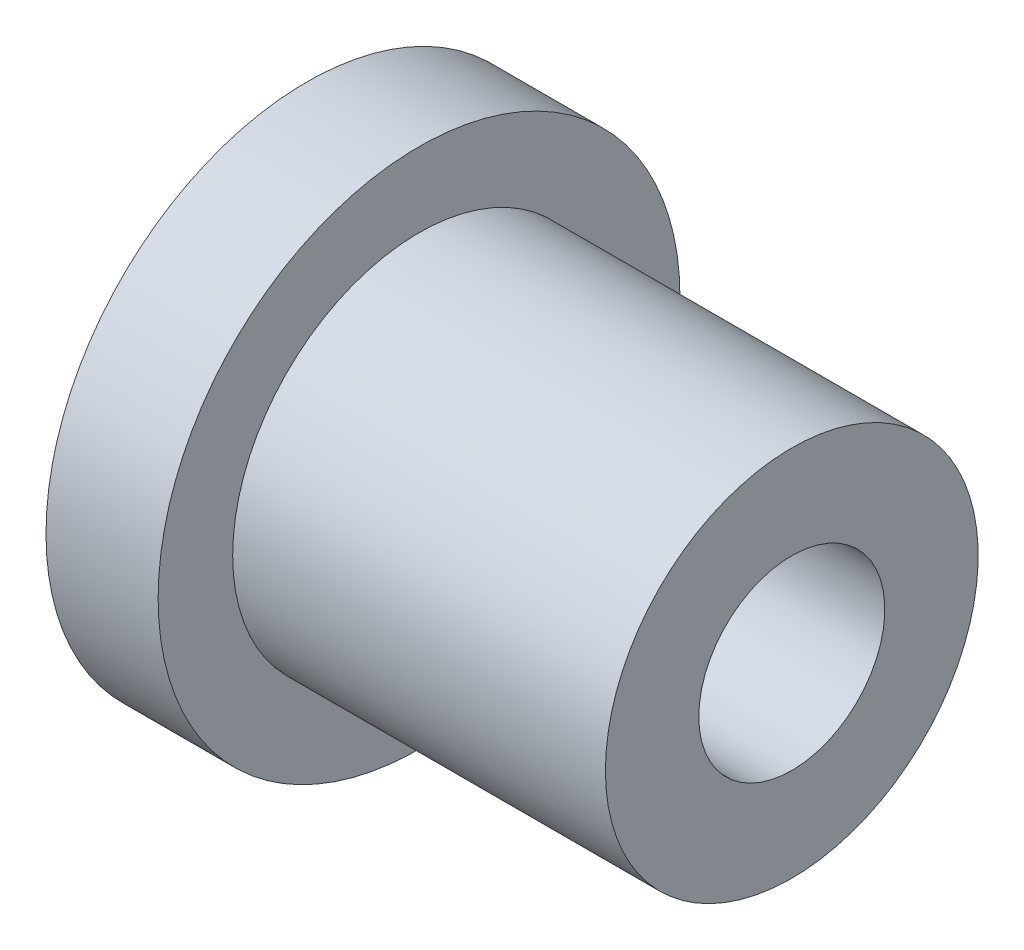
ISO-10303-21;
HEADER;
FILE_DESCRIPTION(('STEP AP214'),'2;1');
FILE_NAME('part.step','',(''),(''),'','','');
FILE_SCHEMA(('AUTOMOTIVE_DESIGN { 1 0 10303 214 1 1 1 1 }'));
ENDSEC;
DATA;
#1=APPLICATION_CONTEXT('core data for automotive mechanical design processes');
#2=APPLICATION_PROTOCOL_DEFINITION('international standard','automotive_design',2000,#1);
#3=PRODUCT_CONTEXT('',#1,'mechanical');
#4=PRODUCT('Part','Part','',(#3));
#5=PRODUCT_RELATED_PRODUCT_CATEGORY('part','',(#4));
#6=PRODUCT_DEFINITION_FORMATION('','',#4);
#7=PRODUCT_DEFINITION_CONTEXT('part definition',#1,'design');
#8=PRODUCT_DEFINITION('design','',#6,#7);
#9=PRODUCT_DEFINITION_SHAPE('','',#8);
#10=(LENGTH_UNIT() NAMED_UNIT(*) SI_UNIT(.MILLI.,.METRE.));
#11=(NAMED_UNIT(*) PLANE_ANGLE_UNIT() SI_UNIT($,.RADIAN.));
#12=(NAMED_UNIT(*) SI_UNIT($,.STERADIAN.) SOLID_ANGLE_UNIT());
#13=UNCERTAINTY_MEASURE_WITH_UNIT(LENGTH_MEASURE(1.E-05),#10,'distance_accuracy_value','');
#14=(GEOMETRIC_REPRESENTATION_CONTEXT(3) GLOBAL_UNCERTAINTY_ASSIGNED_CONTEXT((#13)) GLOBAL_UNIT_ASSIGNED_CONTEXT((#10,
#11,#12)) REPRESENTATION_CONTEXT('',''));
#15=CARTESIAN_POINT('',(0.,0.,0.));
#16=DIRECTION('',(0.,0.,1.));
#17=DIRECTION('',(1.,0.,0.));
#18=AXIS2_PLACEMENT_3D('',#15,#16,#17);
#19=CARTESIAN_POINT('',(0.,11.1125,0.));
#20=DIRECTION('',(1.,0.,0.));
#21=DIRECTION('',(0.,0.,-1.));
#22=AXIS2_PLACEMENT_3D('',#19,#20,#21);
#23=PLANE('',#22);
#24=CARTESIAN_POINT('',(0.,0.,0.));
#25=DIRECTION('',(-1.,0.,0.));
#26=DIRECTION('',(0.,0.,1.));
#27=AXIS2_PLACEMENT_3D('',#24,#25,#26);
#28=CIRCLE('',#27,3.9624);
#29=CARTESIAN_POINT('',(0.,0.,3.9624));
#30=VERTEX_POINT('',#29);
#31=EDGE_CURVE('E10',#30,#30,#28,.T.);
#32=ORIENTED_EDGE('',*,*,#31,.F.);
#33=EDGE_LOOP('',(#32));
#34=FACE_BOUND('',#33,.T.);
#35=CARTESIAN_POINT('',(0.,0.,0.));
#36=DIRECTION('',(-1.,0.,0.));
#37=DIRECTION('',(0.,0.,1.));
#38=AXIS2_PLACEMENT_3D('',#35,#36,#37);
#39=CIRCLE('',#38,11.1125);
#40=CARTESIAN_POINT('',(0.,0.,11.1125));
#41=VERTEX_POINT('',#40);
#42=EDGE_CURVE('E53',#41,#41,#39,.T.);
#43=ORIENTED_EDGE('',*,*,#42,.T.);
#44=EDGE_LOOP('',(#43));
#45=FACE_BOUND('',#44,.T.);
#46=ADVANCED_FACE('F31',(#34,#45),#23,.F.);
#47=CARTESIAN_POINT('',(0.,0.,0.));
#48=DIRECTION('',(-1.,0.,0.));
#49=DIRECTION('',(0.,0.,1.));
#50=AXIS2_PLACEMENT_3D('',#47,#48,#49);
#51=CYLINDRICAL_SURFACE('',#50,3.9624);
#52=CARTESIAN_POINT('',(20.6502,0.,0.));
#53=DIRECTION('',(-1.,0.,0.));
#54=DIRECTION('',(0.,0.,1.));
#55=AXIS2_PLACEMENT_3D('',#52,#53,#54);
#56=CIRCLE('',#55,3.9624);
#57=CARTESIAN_POINT('',(20.6502,0.,3.9624));
#58=VERTEX_POINT('',#57);
#59=EDGE_CURVE('E37',#58,#58,#56,.T.);
#60=ORIENTED_EDGE('',*,*,#59,.F.);
#61=EDGE_LOOP('',(#60));
#62=FACE_BOUND('',#61,.T.);
#63=ORIENTED_EDGE('',*,*,#31,.T.);
#64=EDGE_LOOP('',(#63));
#65=FACE_BOUND('',#64,.T.);
#66=ADVANCED_FACE('F78',(#62,#65),#51,.F.);
#67=CARTESIAN_POINT('',(20.6502,3.9624,0.));
#68=DIRECTION('',(-1.,0.,0.));
#69=DIRECTION('',(0.,0.,1.));
#70=AXIS2_PLACEMENT_3D('',#67,#68,#69);
#71=PLANE('',#70);
#72=CARTESIAN_POINT('',(20.6502,0.,0.));
#73=DIRECTION('',(-1.,0.,0.));
#74=DIRECTION('',(0.,0.,1.));
#75=AXIS2_PLACEMENT_3D('',#72,#73,#74);
#76=CIRCLE('',#75,7.9375);
#77=CARTESIAN_POINT('',(20.6502,0.,7.9375));
#78=VERTEX_POINT('',#77);
#79=EDGE_CURVE('E41',#78,#78,#76,.T.);
#80=ORIENTED_EDGE('',*,*,#79,.F.);
#81=EDGE_LOOP('',(#80));
#82=FACE_BOUND('',#81,.T.);
#83=ORIENTED_EDGE('',*,*,#59,.T.);
#84=EDGE_LOOP('',(#83));
#85=FACE_BOUND('',#84,.T.);
#86=ADVANCED_FACE('F73',(#82,#85),#71,.F.);
#87=CARTESIAN_POINT('',(0.,0.,0.));
#88=DIRECTION('',(-1.,0.,0.));
#89=DIRECTION('',(0.,0.,1.));
#90=AXIS2_PLACEMENT_3D('',#87,#88,#89);
#91=CYLINDRICAL_SURFACE('',#90,7.9375);
#92=CARTESIAN_POINT('',(4.7752,0.,0.));
#93=DIRECTION('',(-1.,0.,0.));
#94=DIRECTION('',(0.,0.,1.));
#95=AXIS2_PLACEMENT_3D('',#92,#93,#94);
#96=CIRCLE('',#95,7.9375);
#97=CARTESIAN_POINT('',(4.7752,0.,7.9375));
#98=VERTEX_POINT('',#97);
#99=EDGE_CURVE('E45',#98,#98,#96,.T.);
#100=ORIENTED_EDGE('',*,*,#99,.F.);
#101=EDGE_LOOP('',(#100));
#102=FACE_BOUND('',#101,.T.);
#103=ORIENTED_EDGE('',*,*,#79,.T.);
#104=EDGE_LOOP('',(#103));
#105=FACE_BOUND('',#104,.T.);
#106=ADVANCED_FACE('F67',(#102,#105),#91,.T.);
#107=CARTESIAN_POINT('',(4.7752,7.9375,0.));
#108=DIRECTION('',(-1.,0.,0.));
#109=DIRECTION('',(0.,0.,1.));
#110=AXIS2_PLACEMENT_3D('',#107,#108,#109);
#111=PLANE('',#110);
#112=CARTESIAN_POINT('',(4.7752,0.,0.));
#113=DIRECTION('',(-1.,0.,0.));
#114=DIRECTION('',(0.,0.,1.));
#115=AXIS2_PLACEMENT_3D('',#112,#113,#114);
#116=CIRCLE('',#115,11.1125);
#117=CARTESIAN_POINT('',(4.7752,0.,11.1125));
#118=VERTEX_POINT('',#117);
#119=EDGE_CURVE('E50',#118,#118,#116,.T.);
#120=ORIENTED_EDGE('',*,*,#119,.F.);
#121=EDGE_LOOP('',(#120));
#122=FACE_BOUND('',#121,.T.);
#123=ORIENTED_EDGE('',*,*,#99,.T.);
#124=EDGE_LOOP('',(#123));
#125=FACE_BOUND('',#124,.T.);
#126=ADVANCED_FACE('F61',(#122,#125),#111,.F.);
#127=CARTESIAN_POINT('',(0.,0.,0.));
#128=DIRECTION('',(-1.,0.,0.));
#129=DIRECTION('',(0.,0.,1.));
#130=AXIS2_PLACEMENT_3D('',#127,#128,#129);
#131=CYLINDRICAL_SURFACE('',#130,11.1125);
#132=ORIENTED_EDGE('',*,*,#42,.F.);
#133=EDGE_LOOP('',(#132));
#134=FACE_BOUND('',#133,.T.);
#135=ORIENTED_EDGE('',*,*,#119,.T.);
#136=EDGE_LOOP('',(#135));
#137=FACE_BOUND('',#136,.T.);
#138=ADVANCED_FACE('F58',(#134,#137),#131,.T.);
#139=CLOSED_SHELL('',(#46,#66,#86,#106,#126,#138));
#140=MANIFOLD_SOLID_BREP('B2',#139);
#141=ADVANCED_BREP_SHAPE_REPRESENTATION('',(#18,#140),#14);
#142=SHAPE_DEFINITION_REPRESENTATION(#9,#141);
ENDSEC;
END-ISO-10303-21;
